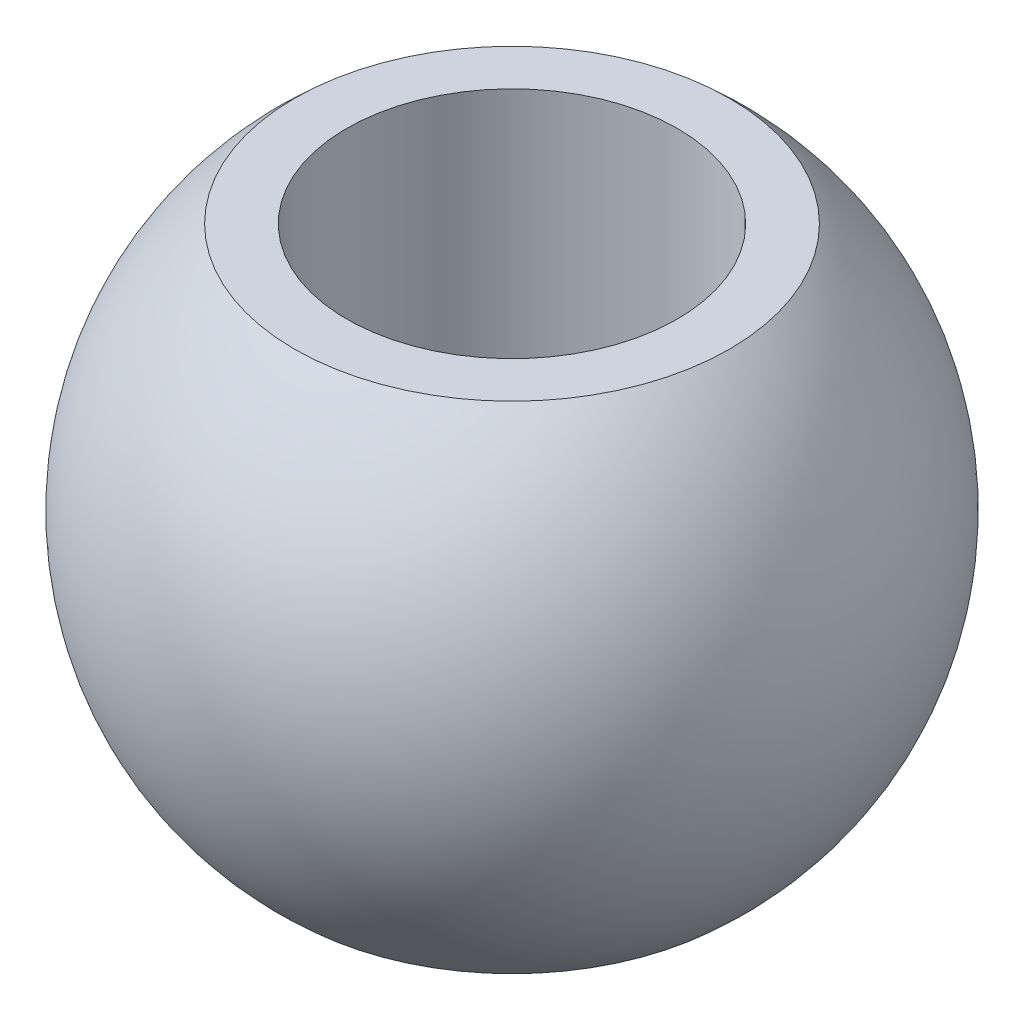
ISO-10303-21;
HEADER;
FILE_DESCRIPTION(('STEP AP214'),'2;1');
FILE_NAME('part.step','',(''),(''),'','','');
FILE_SCHEMA(('AUTOMOTIVE_DESIGN { 1 0 10303 214 1 1 1 1 }'));
ENDSEC;
DATA;
#1=APPLICATION_CONTEXT('core data for automotive mechanical design processes');
#2=APPLICATION_PROTOCOL_DEFINITION('international standard','automotive_design',2000,#1);
#3=PRODUCT_CONTEXT('',#1,'mechanical');
#4=PRODUCT('Part','Part','',(#3));
#5=PRODUCT_RELATED_PRODUCT_CATEGORY('part','',(#4));
#6=PRODUCT_DEFINITION_FORMATION('','',#4);
#7=PRODUCT_DEFINITION_CONTEXT('part definition',#1,'design');
#8=PRODUCT_DEFINITION('design','',#6,#7);
#9=PRODUCT_DEFINITION_SHAPE('','',#8);
#10=(LENGTH_UNIT() NAMED_UNIT(*) SI_UNIT(.MILLI.,.METRE.));
#11=(NAMED_UNIT(*) PLANE_ANGLE_UNIT() SI_UNIT($,.RADIAN.));
#12=(NAMED_UNIT(*) SI_UNIT($,.STERADIAN.) SOLID_ANGLE_UNIT());
#13=UNCERTAINTY_MEASURE_WITH_UNIT(LENGTH_MEASURE(1.E-05),#10,'distance_accuracy_value','');
#14=(GEOMETRIC_REPRESENTATION_CONTEXT(3) GLOBAL_UNCERTAINTY_ASSIGNED_CONTEXT((#13)) GLOBAL_UNIT_ASSIGNED_CONTEXT((#10,
#11,#12)) REPRESENTATION_CONTEXT('',''));
#15=CARTESIAN_POINT('',(0.,0.,0.));
#16=DIRECTION('',(0.,0.,1.));
#17=DIRECTION('',(1.,0.,0.));
#18=AXIS2_PLACEMENT_3D('',#15,#16,#17);
#19=CARTESIAN_POINT('',(-5.26121658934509,6.,0.));
#20=DIRECTION('',(0.,-1.,0.));
#21=DIRECTION('',(0.,0.,-1.));
#22=AXIS2_PLACEMENT_3D('',#19,#20,#21);
#23=PLANE('',#22);
#24=CARTESIAN_POINT('',(0.,6.,0.));
#25=DIRECTION('',(0.,-1.,0.));
#26=DIRECTION('',(0.,0.,-1.));
#27=AXIS2_PLACEMENT_3D('',#24,#25,#26);
#28=CIRCLE('',#27,5.26121658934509);
#29=CARTESIAN_POINT('',(-5.26121658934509,6.,0.));
#30=VERTEX_POINT('',#29);
#31=EDGE_CURVE('E10',#30,#30,#28,.T.);
#32=ORIENTED_EDGE('',*,*,#31,.F.);
#33=EDGE_LOOP('',(#32));
#34=FACE_BOUND('',#33,.T.);
#35=CARTESIAN_POINT('',(0.,6.,0.));
#36=DIRECTION('',(0.,-1.,0.));
#37=DIRECTION('',(0.,0.,-1.));
#38=AXIS2_PLACEMENT_3D('',#35,#36,#37);
#39=CIRCLE('',#38,4.);
#40=CARTESIAN_POINT('',(0.,6.,-4.));
#41=VERTEX_POINT('',#40);
#42=EDGE_CURVE('E51',#41,#41,#39,.T.);
#43=ORIENTED_EDGE('',*,*,#42,.T.);
#44=EDGE_LOOP('',(#43));
#45=FACE_BOUND('',#44,.T.);
#46=ADVANCED_FACE('F37',(#34,#45),#23,.F.);
#47=CARTESIAN_POINT('',(0.,0.,0.));
#48=DIRECTION('',(0.,-1.,0.));
#49=DIRECTION('',(-1.,0.,0.));
#50=AXIS2_PLACEMENT_3D('',#47,#48,#49);
#51=SPHERICAL_SURFACE('',#50,7.98);
#52=CARTESIAN_POINT('',(0.,-6.,0.));
#53=DIRECTION('',(0.,-1.,0.));
#54=DIRECTION('',(0.,0.,-1.));
#55=AXIS2_PLACEMENT_3D('',#52,#53,#54);
#56=CIRCLE('',#55,5.26121658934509);
#57=CARTESIAN_POINT('',(-5.26121658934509,-6.,0.));
#58=VERTEX_POINT('',#57);
#59=EDGE_CURVE('E43',#58,#58,#56,.T.);
#60=CARTESIAN_POINT('',(-5.26121658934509,-6.,0.));
#61=CARTESIAN_POINT('',(-5.3675828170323,-5.90673578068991,0.));
#62=CARTESIAN_POINT('',(-5.47146378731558,-5.81063785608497,0.));
#63=CARTESIAN_POINT('',(-5.67397318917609,-5.61305833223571,0.));
#64=CARTESIAN_POINT('',(-5.77260162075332,-5.51157673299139,0.));
#65=CARTESIAN_POINT('',(-5.96432392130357,-5.30351359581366,0.));
#66=CARTESIAN_POINT('',(-6.05741779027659,-5.19693205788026,0.));
#67=CARTESIAN_POINT('',(-6.23780857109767,-4.97897127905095,0.));
#68=CARTESIAN_POINT('',(-6.32510548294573,-4.86759203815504,0.));
#69=CARTESIAN_POINT('',(-6.4936552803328,-4.64035056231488,0.));
#70=CARTESIAN_POINT('',(-6.57490816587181,-4.52448832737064,0.));
#71=CARTESIAN_POINT('',(-6.73114021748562,-4.28860854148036,0.));
#72=CARTESIAN_POINT('',(-6.80611938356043,-4.16859099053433,0.));
#73=CARTESIAN_POINT('',(-6.94959196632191,-3.92473992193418,0.));
#74=CARTESIAN_POINT('',(-7.01808538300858,-3.80090640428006,0.));
#75=CARTESIAN_POINT('',(-7.14839279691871,-3.54977356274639,0.));
#76=CARTESIAN_POINT('',(-7.21020679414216,-3.42247423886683,0.));
#77=CARTESIAN_POINT('',(-7.32698058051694,-3.16476973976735,0.));
#78=CARTESIAN_POINT('',(-7.38194036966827,-3.03436456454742,0.));
#79=CARTESIAN_POINT('',(-7.48485033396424,-2.77081710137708,0.));
#80=CARTESIAN_POINT('',(-7.53280050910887,-2.63767481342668,0.));
#81=CARTESIAN_POINT('',(-7.62155565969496,-2.36902960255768,0.));
#82=CARTESIAN_POINT('',(-7.66236063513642,-2.23352667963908,0.));
#83=CARTESIAN_POINT('',(-7.7367100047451,-1.96054335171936,0.));
#84=CARTESIAN_POINT('',(-7.77025439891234,-1.82306294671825,0.));
#85=CARTESIAN_POINT('',(-7.82998775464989,-1.54651339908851,0.));
#86=CARTESIAN_POINT('',(-7.8561767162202,-1.40744425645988,0.));
#87=CARTESIAN_POINT('',(-7.90112515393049,-1.12811047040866,0.));
#88=CARTESIAN_POINT('',(-7.91988463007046,-0.987845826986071,0.));
#89=CARTESIAN_POINT('',(-7.94992105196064,-0.706517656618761,0.));
#90=CARTESIAN_POINT('',(-7.96119799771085,-0.565454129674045,0.));
#91=CARTESIAN_POINT('',(-7.97623747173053,-0.282927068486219,0.));
#92=CARTESIAN_POINT('',(-7.98,-0.141463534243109,0.));
#93=CARTESIAN_POINT('',(-7.98,0.141463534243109,0.));
#94=CARTESIAN_POINT('',(-7.97623747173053,0.282927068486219,0.));
#95=CARTESIAN_POINT('',(-7.96119799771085,0.565454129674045,0.));
#96=CARTESIAN_POINT('',(-7.94992105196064,0.706517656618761,0.));
#97=CARTESIAN_POINT('',(-7.91988463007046,0.987845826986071,0.));
#98=CARTESIAN_POINT('',(-7.90112515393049,1.12811047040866,0.));
#99=CARTESIAN_POINT('',(-7.8561767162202,1.40744425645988,0.));
#100=CARTESIAN_POINT('',(-7.82998775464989,1.54651339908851,0.));
#101=CARTESIAN_POINT('',(-7.77025439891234,1.82306294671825,0.));
#102=CARTESIAN_POINT('',(-7.7367100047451,1.96054335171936,0.));
#103=CARTESIAN_POINT('',(-7.66236063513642,2.23352667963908,0.));
#104=CARTESIAN_POINT('',(-7.62155565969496,2.36902960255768,0.));
#105=CARTESIAN_POINT('',(-7.53280050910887,2.63767481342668,0.));
#106=CARTESIAN_POINT('',(-7.48485033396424,2.77081710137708,0.));
#107=CARTESIAN_POINT('',(-7.38194036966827,3.03436456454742,0.));
#108=CARTESIAN_POINT('',(-7.32698058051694,3.16476973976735,0.));
#109=CARTESIAN_POINT('',(-7.21020679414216,3.42247423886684,0.));
#110=CARTESIAN_POINT('',(-7.14839279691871,3.54977356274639,0.));
#111=CARTESIAN_POINT('',(-7.01808538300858,3.80090640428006,0.));
#112=CARTESIAN_POINT('',(-6.94959196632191,3.92473992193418,0.));
#113=CARTESIAN_POINT('',(-6.80611938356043,4.16859099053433,0.));
#114=CARTESIAN_POINT('',(-6.73114021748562,4.28860854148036,0.));
#115=CARTESIAN_POINT('',(-6.57490816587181,4.52448832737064,0.));
#116=CARTESIAN_POINT('',(-6.4936552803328,4.64035056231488,0.));
#117=CARTESIAN_POINT('',(-6.32510548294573,4.86759203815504,0.));
#118=CARTESIAN_POINT('',(-6.23780857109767,4.97897127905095,0.));
#119=CARTESIAN_POINT('',(-6.05741779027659,5.19693205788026,0.));
#120=CARTESIAN_POINT('',(-5.96432392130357,5.30351359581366,0.));
#121=CARTESIAN_POINT('',(-5.77260162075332,5.51157673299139,0.));
#122=CARTESIAN_POINT('',(-5.67397318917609,5.61305833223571,0.));
#123=CARTESIAN_POINT('',(-5.47146378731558,5.81063785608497,0.));
#124=CARTESIAN_POINT('',(-5.3675828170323,5.90673578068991,0.));
#125=CARTESIAN_POINT('',(-5.26121658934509,6.,0.));
#126=B_SPLINE_CURVE_WITH_KNOTS('',3,(#60,#61,#62,#63,#64,#65,#66,#67,#68,#69,#70,#71,#72,#73,
#74,#75,#76,#77,#78,#79,#80,#81,#82,#83,#84,#85,#86,#87,#88,#89,#90,#91,#92,#93,#94,#95,#96,#97,
#98,#99,#100,#101,#102,#103,#104,#105,#106,#107,#108,#109,#110,#111,#112,#113,#114,#115,#116,
#117,#118,#119,#120,#121,#122,#123,#124,#125),.UNSPECIFIED.,.F.,.F.,(4,2,2,2,2,2,2,2,2,2,2,2,2,
2,2,2,2,2,2,2,2,2,2,2,2,2,2,2,2,2,2,2,4),(0.,0.424340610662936,0.848681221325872,
1.27302183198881,1.69736244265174,2.12170305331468,2.54604366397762,2.97038427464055,
3.39472488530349,3.81906549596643,4.24340610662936,4.6677467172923,5.09208732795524,
5.51642793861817,5.94076854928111,6.36510915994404,6.78944977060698,7.21379038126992,
7.63813099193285,8.06247160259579,8.48681221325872,8.91115282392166,9.3354934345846,
9.75983404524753,10.1841746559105,10.6085152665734,11.0328558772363,11.4571964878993,
11.8815370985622,12.3058777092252,12.7302183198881,13.154558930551,13.578899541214),.UNSPECIFIED.);
#127=EDGE_CURVE('BSEAM66',#58,#30,#126,.T.);
#128=ORIENTED_EDGE('',*,*,#59,.F.);
#129=ORIENTED_EDGE('',*,*,#31,.T.);
#130=ORIENTED_EDGE('',*,*,#127,.T.);
#131=ORIENTED_EDGE('',*,*,#127,.F.);
#132=EDGE_LOOP('',(#128,#130,#129,#131));
#133=FACE_BOUND('',#132,.T.);
#134=ADVANCED_FACE('F66',(#133),#51,.T.);
#135=CARTESIAN_POINT('',(-4.,-6.,0.));
#136=DIRECTION('',(0.,1.,0.));
#137=DIRECTION('',(0.,0.,1.));
#138=AXIS2_PLACEMENT_3D('',#135,#136,#137);
#139=PLANE('',#138);
#140=CARTESIAN_POINT('',(0.,-6.,0.));
#141=DIRECTION('',(0.,-1.,0.));
#142=DIRECTION('',(0.,0.,-1.));
#143=AXIS2_PLACEMENT_3D('',#140,#141,#142);
#144=CIRCLE('',#143,4.);
#145=CARTESIAN_POINT('',(0.,-6.,-4.));
#146=VERTEX_POINT('',#145);
#147=EDGE_CURVE('E47',#146,#146,#144,.T.);
#148=ORIENTED_EDGE('',*,*,#147,.F.);
#149=EDGE_LOOP('',(#148));
#150=FACE_BOUND('',#149,.T.);
#151=ORIENTED_EDGE('',*,*,#59,.T.);
#152=EDGE_LOOP('',(#151));
#153=FACE_BOUND('',#152,.T.);
#154=ADVANCED_FACE('F61',(#150,#153),#139,.F.);
#155=CARTESIAN_POINT('',(0.,0.,0.));
#156=DIRECTION('',(0.,-1.,0.));
#157=DIRECTION('',(0.,0.,-1.));
#158=AXIS2_PLACEMENT_3D('',#155,#156,#157);
#159=CYLINDRICAL_SURFACE('',#158,4.);
#160=ORIENTED_EDGE('',*,*,#42,.F.);
#161=EDGE_LOOP('',(#160));
#162=FACE_BOUND('',#161,.T.);
#163=ORIENTED_EDGE('',*,*,#147,.T.);
#164=EDGE_LOOP('',(#163));
#165=FACE_BOUND('',#164,.T.);
#166=ADVANCED_FACE('F58',(#162,#165),#159,.F.);
#167=CLOSED_SHELL('',(#46,#134,#154,#166));
#168=MANIFOLD_SOLID_BREP('B2',#167);
#169=ADVANCED_BREP_SHAPE_REPRESENTATION('',(#18,#168),#14);
#170=SHAPE_DEFINITION_REPRESENTATION(#9,#169);
ENDSEC;
END-ISO-10303-21;
